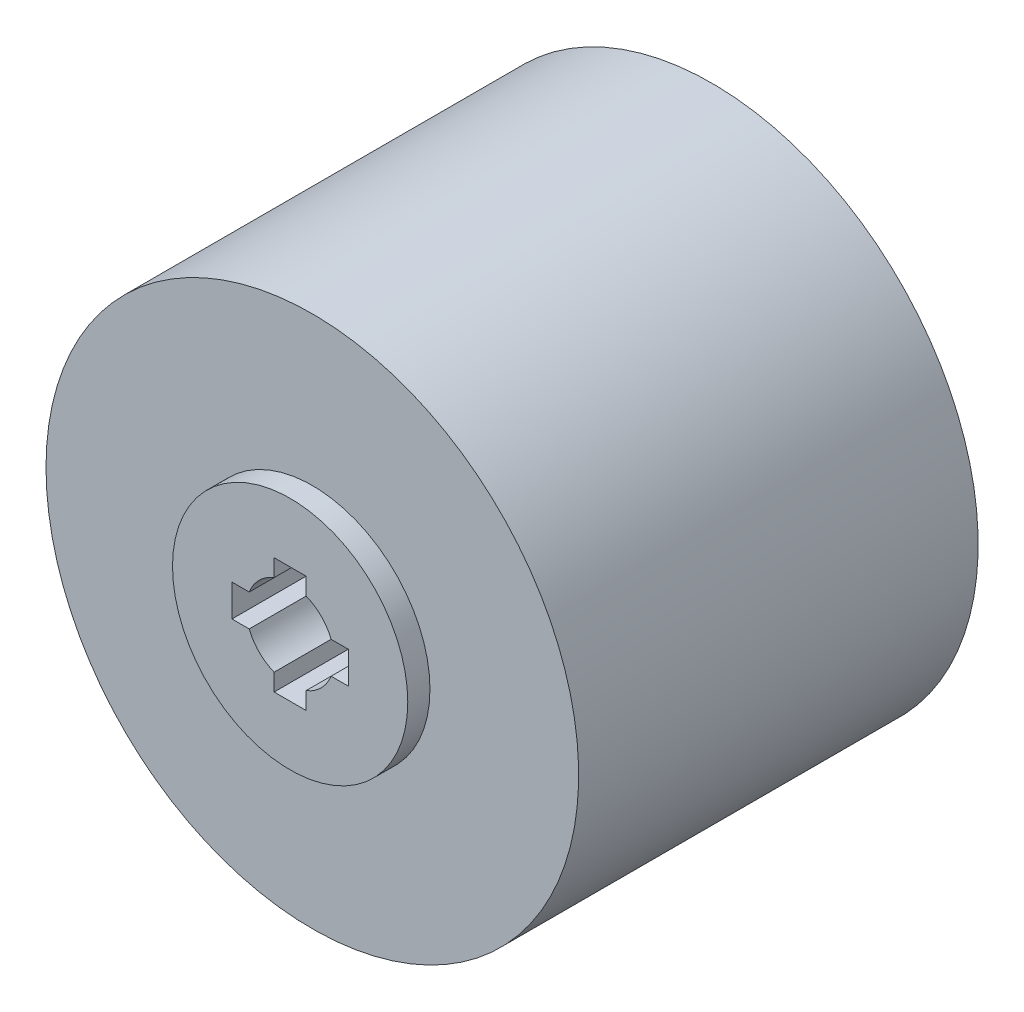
from build123d import *

# Parameters (mm, degrees)
ESQUISSE1_R             = 26.5
BOSS_EXTRU_1_DEPTH      = 50
ESQUISSE3_R             = 60
BOSS_EXTRU_2_DEPTH      = 45
ESQUISSE4_R             = 9.9
ESQUISSE4_W             = 26.2
ESQUISSE4_H             = 7.2
ESQUISSE4_W_2           = 7.2
ESQUISSE4_H_2           = 26.2
ENL_V_MAT_EXTRU_1_DEPTH = 132.148770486


with BuildPart() as part:
    # Esquisse1 → Boss.-Extru.1 (new body)
    with BuildSketch(Plane.XY):
        Circle(ESQUISSE1_R)
    boss_extru_1 = extrude(amount=BOSS_EXTRU_1_DEPTH)

    # Esquisse3 → Boss.-Extru.2 (add)
    with BuildSketch(Plane(origin=(0, 0, 0), x_dir=(-1, 0, 0), z_dir=(0, 0, -1))):
        Circle(ESQUISSE3_R)
    boss_extru_2 = extrude(amount=-BOSS_EXTRU_2_DEPTH)


with BuildPart() as sym_trie1_1:
    # Sym_trie1: Boss.-Extru.1, Boss.-Extru.2 across Front Plane
    add(boss_extru_1.mirror(Plane.XY))
    add(boss_extru_2.mirror(Plane.XY))


with BuildPart() as part_1:
    add(part.part)

    # Sym_trie1 united with what the copies to: union Sym_trie1_1
    add(sym_trie1_1.part)

    # Esquisse4 → Enl_v. mat.-Extru.1 (cut, through all)
    with BuildSketch(Plane.XY.offset(50)):
        Circle(ESQUISSE4_R)
        Rectangle(ESQUISSE4_W, ESQUISSE4_H)
        Rectangle(ESQUISSE4_W_2, ESQUISSE4_H_2)
    extrude(amount=-ENL_V_MAT_EXTRU_1_DEPTH, mode=Mode.SUBTRACT)


solid = part_1.part
